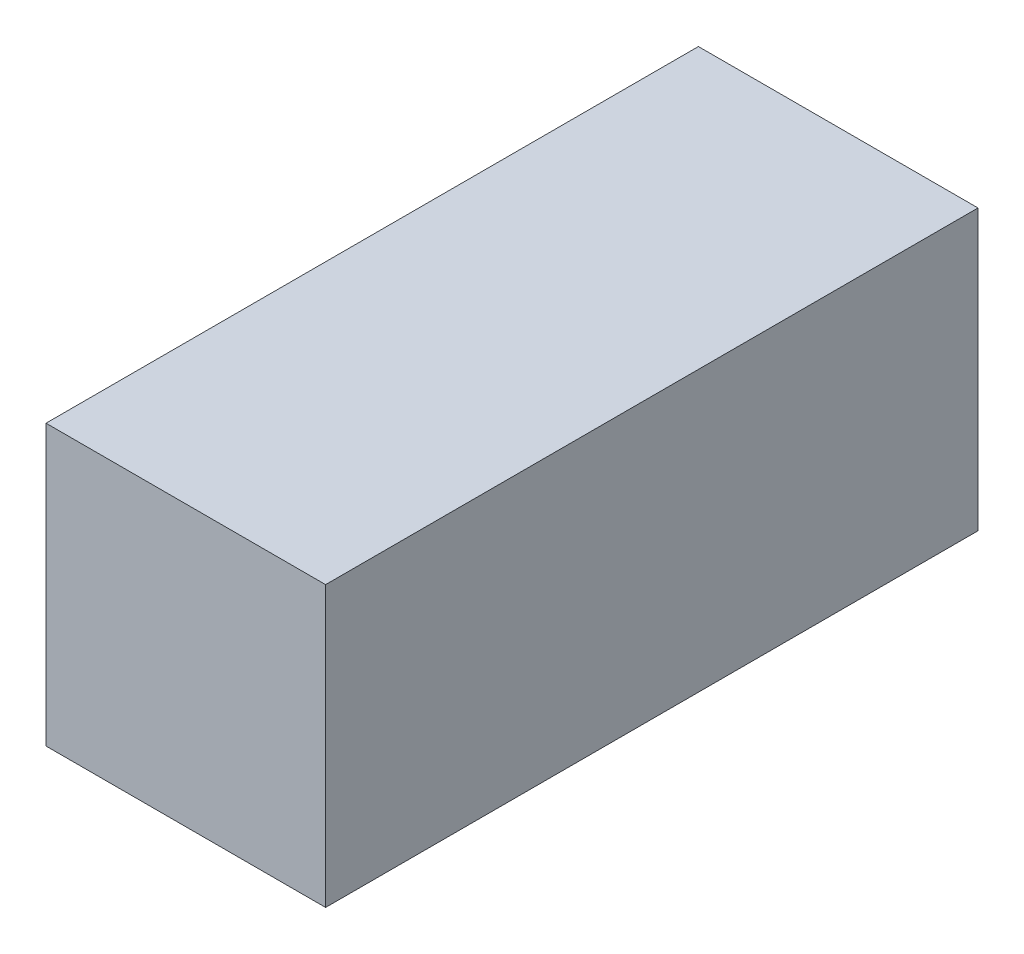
from build123d import *

# Parameters (mm, degrees)
ESQUISSE1_W          = 3
ESQUISSE1_H          = 3
BASE_EXTRUSION_DEPTH = 7


with BuildPart() as part:
    # Esquisse1 → Base-Extrusion (new body)
    with BuildSketch(Plane.XY):
        with Locations((1.5, 1.5)):
            Rectangle(ESQUISSE1_W, ESQUISSE1_H)
    extrude(amount=BASE_EXTRUSION_DEPTH)


solid = part.part
